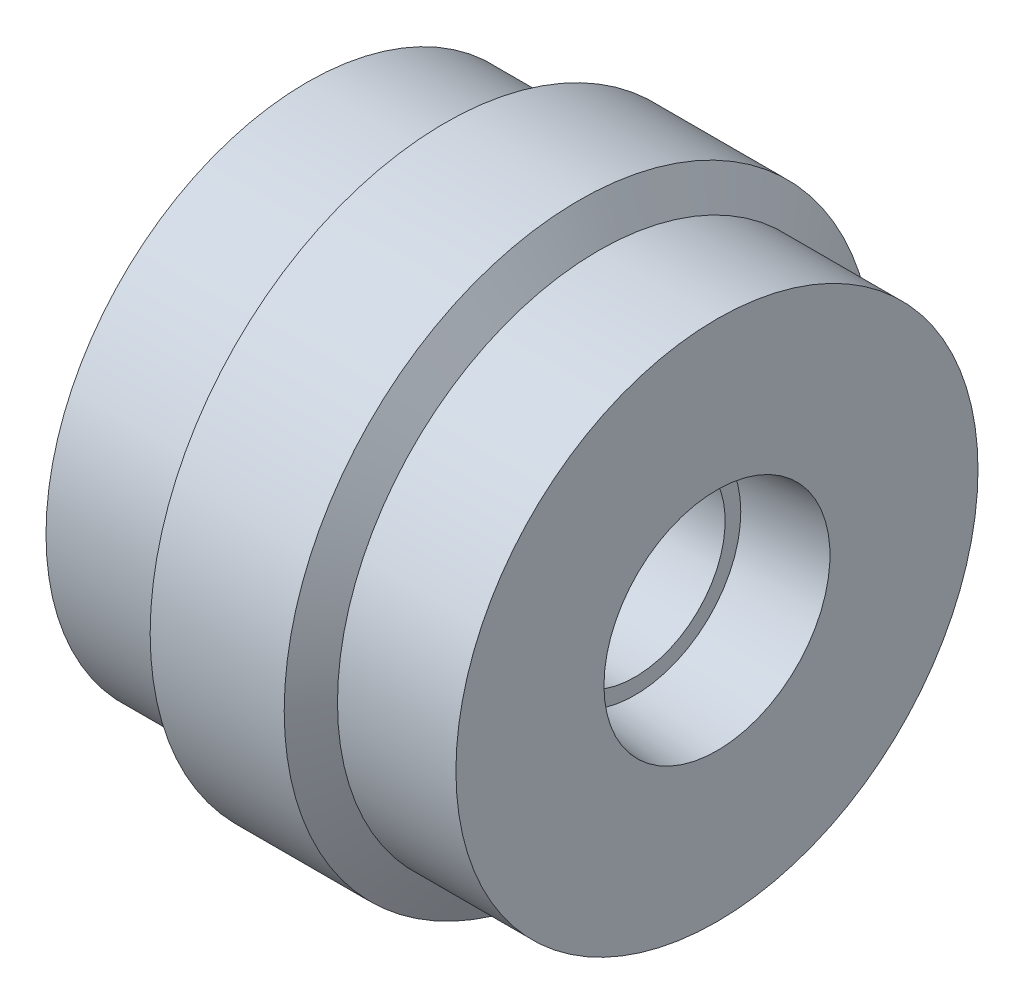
from build123d import *


with BuildPart() as part:
    # Sketch1 → Revolve1 (revolve)
    with BuildSketch(Plane.XY, mode=Mode.PRIVATE) as revolve1_sk:
        Polygon((0, 15.9004), (7.2136, 15.9004), (8.401440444, 17.9578), (16.566759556, 17.9578), (17.7546, 15.9004), (24.9682, 15.9004), (24.9682, 6.8834), (19.9682, 6.4516), (19.9682, 5.5), (5, 5.5), (5, 6.4516), (0, 6.8834), align=None)
    revolve(revolve1_sk.sketch.rotate(Axis((0, 0, 0), (1, 0, 0)), 90), axis=Axis((0, 0, 0), (1, 0, 0)))


solid = part.part
